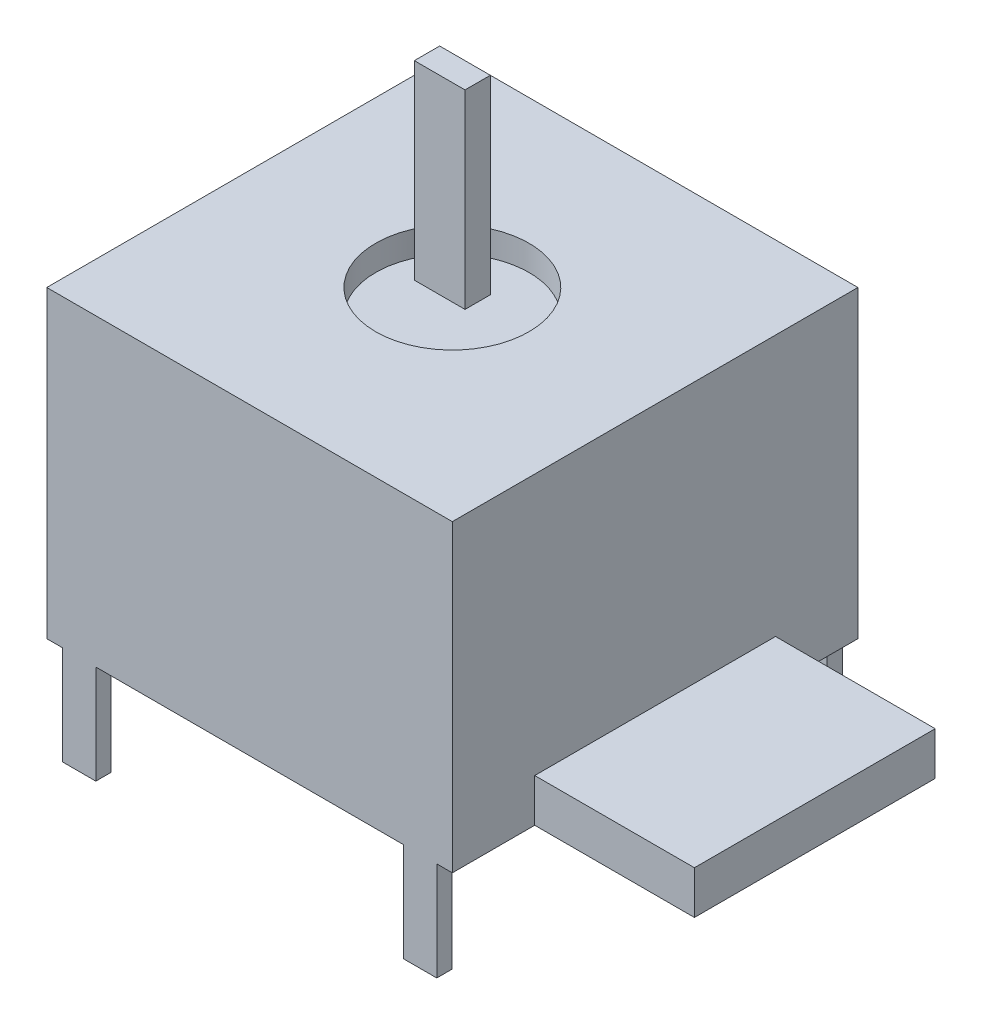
from build123d import *

# Parameters (mm, degrees)
ESQUISSE1_W             = 16
ESQUISSE1_H             = 16
EXTRUSION1_DEPTH        = 12
ESQUISSE2_W             = 9.5
ESQUISSE2_H             = 1.7
EXTRUSION2_DEPTH        = 6.3
ESQUISSE3_W             = 1.32
ESQUISSE3_H             = 0.6
EXTRUSION3_DEPTH        = 3.9
ESQUISSE4_W             = 2
ESQUISSE4_H             = 1
EXTRUSION4_DEPTH        = 7.5
ESQUISSE5_R             = 3.025688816
ENL_V_MAT_EXTRU_2_DEPTH = 1


with BuildPart() as part:
    # Esquisse1 → Extrusion1 (new body)
    with BuildSketch(Plane(origin=(0, 0, 0), x_dir=(1, 0, 0), z_dir=(0, 1, 0))):
        with Locations((8, 8)):
            Rectangle(ESQUISSE1_W, ESQUISSE1_H)
    extrude(amount=EXTRUSION1_DEPTH)

    # Esquisse2 → Extrusion2 (add)
    with BuildSketch(Plane(origin=(16, 0, 0), x_dir=(0, 0, -1), z_dir=(1, 0, 0))):
        with Locations((8, 0.85)):
            Rectangle(ESQUISSE2_W, ESQUISSE2_H)
    extrude(amount=EXTRUSION2_DEPTH)

    # Esquisse3 → Extrusion3 (add)
    with BuildSketch(Plane.XZ):
        with Locations((1.275, -0.3)):
            Rectangle(ESQUISSE3_W, ESQUISSE3_H)
        with Locations((14.725, -0.3)):
            Rectangle(ESQUISSE3_W, ESQUISSE3_H)
        with Locations((14.725, -15.7)):
            Rectangle(ESQUISSE3_W, ESQUISSE3_H)
        with Locations((1.275, -15.7)):
            Rectangle(ESQUISSE3_W, ESQUISSE3_H)
    extrude(amount=EXTRUSION3_DEPTH)

    # Esquisse4 → Extrusion4 (add)
    with BuildSketch(Plane(origin=(0, 12, 0), x_dir=(-1, 0, 0), z_dir=(0, 1, 0))):
        with Locations((-8, -8)):
            Rectangle(ESQUISSE4_W, ESQUISSE4_H)
    extrude(amount=EXTRUSION4_DEPTH)

    # Esquisse5 → Enl_v. mat.-Extru.2 (cut)
    with BuildSketch(Plane(origin=(0, 12, 0), x_dir=(-1, 0, 0), z_dir=(0, 1, 0))):
        with Locations(Location((-8, -8, 0), (0, 0, 90))):
            Circle(ESQUISSE5_R)
    extrude(amount=-ENL_V_MAT_EXTRU_2_DEPTH, mode=Mode.SUBTRACT)


with BuildPart() as enl_v_mat_extru_2_piece_1:
    # of the separate pieces the step leaves, piece 1, a body of its own (enl_v_mat_extru_2_pieces)
    add(part.part.solids().sort_by_distance((0, 0, 0))[0])


with BuildPart() as enl_v_mat_extru_2_piece_2:
    # of the separate pieces the step leaves, piece 2, a body of its own (enl_v_mat_extru_2_pieces)
    add(part.part.solids().sort_by_distance((9, 12, -8.5))[0])


solid = Compound([enl_v_mat_extru_2_piece_1.part, enl_v_mat_extru_2_piece_2.part])
